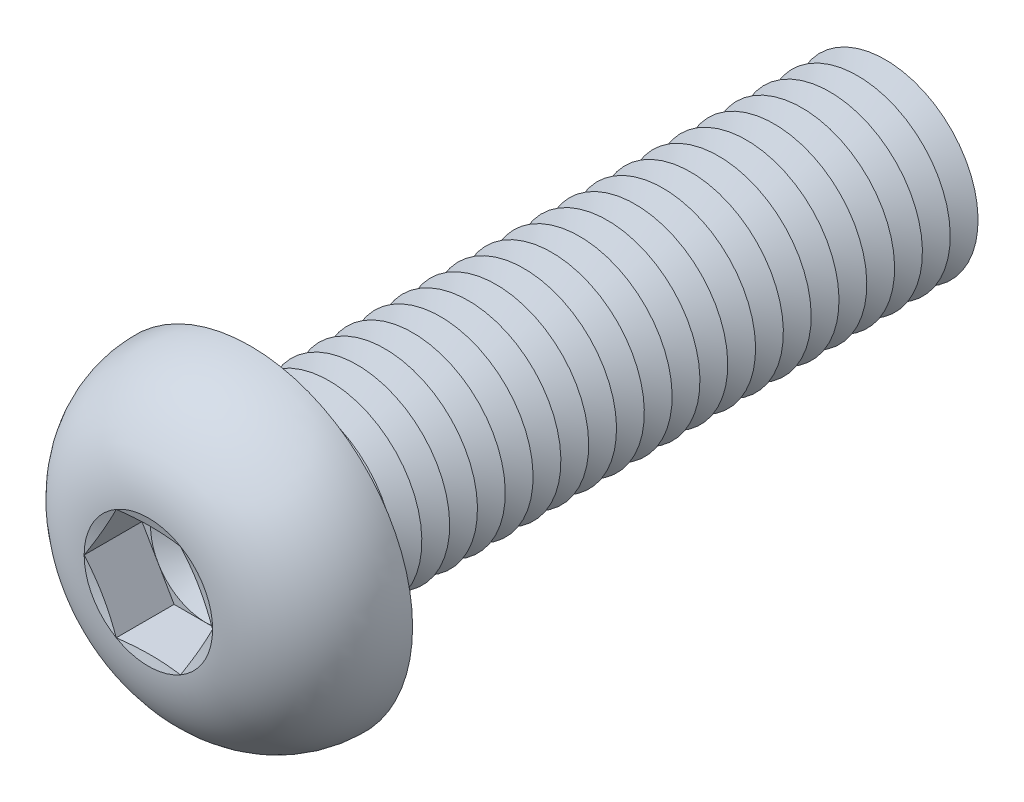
from build123d import *

# Parameters (mm, degrees)
FILLET1_R          = 0.75
LPATTERN1_COUNT    = 23
LPATTERN1_PITCH    = 1.5
CUT_EXTRUDE1_DEPTH = 3.12


with BuildPart() as part:
    # Sketch1 → Revolve1 (revolve)
    with BuildSketch(Plane(origin=(0, 0, 0), x_dir=(0, 0, -1), z_dir=(1, 0, 0))):
        with BuildLine():
            Line((0, 5), (0, 8.75))
            ThreePointArc((0, 8.75), (-3.814142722, 7.21429474), (-5.5, 3.4641))
            Line((-5.5, 3.4641), (-5.035898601, 1.73205))
            Line((-5.035898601, 1.73205), (-5.5, 1.73205))
            Line((-5.5, 1.73205), (-5.5, 0))
            Line((-5.5, 0), (35, 0))
            Line((35, 0), (35, 5))
            Line((35, 5), (0, 5))
        make_face()
    revolve(axis=Axis((0, 0, -35), (0, 0, 1)))

    # Fillet1
    fillet1_edges = [part.edges().sort_by_distance(p)[0] for p in [
        (0, -5, 0),
    ]]
    fillet(fillet1_edges, radius=FILLET1_R)

    # Sketch2 → Cut-Revolve1 (revolve, cut)
    with BuildSketch(Plane(origin=(0, 0, 0), x_dir=(0, 0, -1), z_dir=(1, 0, 0))):
        Polygon((34.25, 5), (35.75, 5), (35, 3.700961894), align=None)
    cut_revolve1 = revolve(axis=Axis((0, 0, -35), (0, 0, -1)), mode=Mode.SUBTRACT)

    # LPattern1: Cut-Revolve1 ×23
    with Locations(*[(0, 0, i * LPATTERN1_PITCH) for i in range(1, LPATTERN1_COUNT)]):
        add(cut_revolve1, mode=Mode.SUBTRACT)

    # Sketch3 → Cut-Extrude1 (cut)
    with BuildSketch(Plane.XY.offset(5.5)):
        Polygon((1.73205, 2.999998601), (-1.73205, 2.999998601), (-3.4641, 0), (-1.73205, -2.999998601), (1.73205, -2.999998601), (3.4641, 0), align=None)
    extrude(amount=-CUT_EXTRUDE1_DEPTH, mode=Mode.SUBTRACT)

    # Cut-Extrude2 cone 1 section (on through the dimple's axis) → Cut-Extrude2 (revolve, cut)
    with BuildSketch(Plane(origin=(0, 0, 2.38), x_dir=(0, -1, 0), z_dir=(1, 0, 0))):
        Polygon((0, 0), (2.999998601, 0), (0, 1.73205), align=None)
    revolve(axis=Axis((0, 0, 2.38), (0, 0, -1)), mode=Mode.SUBTRACT)


solid = part.part
